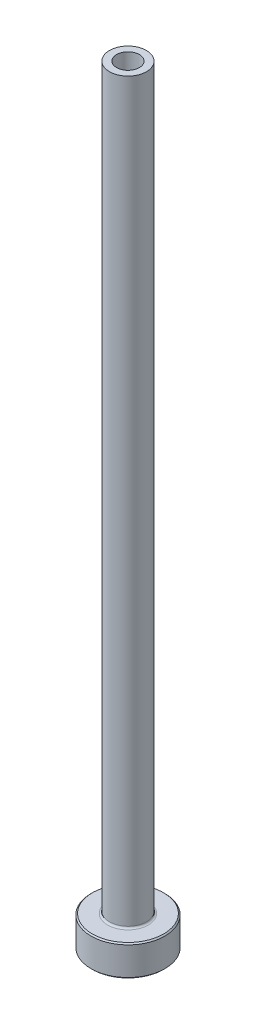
from build123d import *

# Parameters (mm, degrees)
FILLET1_R     = 0.3
CHAMFER1_SIZE = 0.2
CHAMFER3_SIZE = 0.5


with BuildPart() as part:
    # Sketch1 → Revolve1 (revolve)
    with BuildSketch(Plane.XY, mode=Mode.PRIVATE) as revolve1_sk:
        Polygon((-1.85, 125), (-3, 125), (-3, 5), (-6, 5), (-6, 0), (-2.1, 0), (-2.1, 68), (-1.85, 80), align=None)
    revolve(revolve1_sk.sketch.rotate(Axis((0, 92.187680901, 0), (0, -1, 0)), 270), axis=Axis((0, 92.187680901, 0), (0, -1, 0)))

    # Fillet1
    fillet1_edges = [part.edges().sort_by_distance(p)[0] for p in [
        (0, 5, -3),
    ]]
    fillet(fillet1_edges, radius=FILLET1_R)

    # Chamfer1
    chamfer1_edges = [part.edges().sort_by_distance(p)[0] for p in [
        (0, 0, -6),
        (0, 5, -6),
    ]]
    chamfer(chamfer1_edges, length=CHAMFER1_SIZE)

    # Chamfer3
    chamfer3_edges = [part.edges().sort_by_distance(p)[0] for p in [
        (0, 0, -2.1),
    ]]
    chamfer(chamfer3_edges, length=CHAMFER3_SIZE)


solid = part.part
